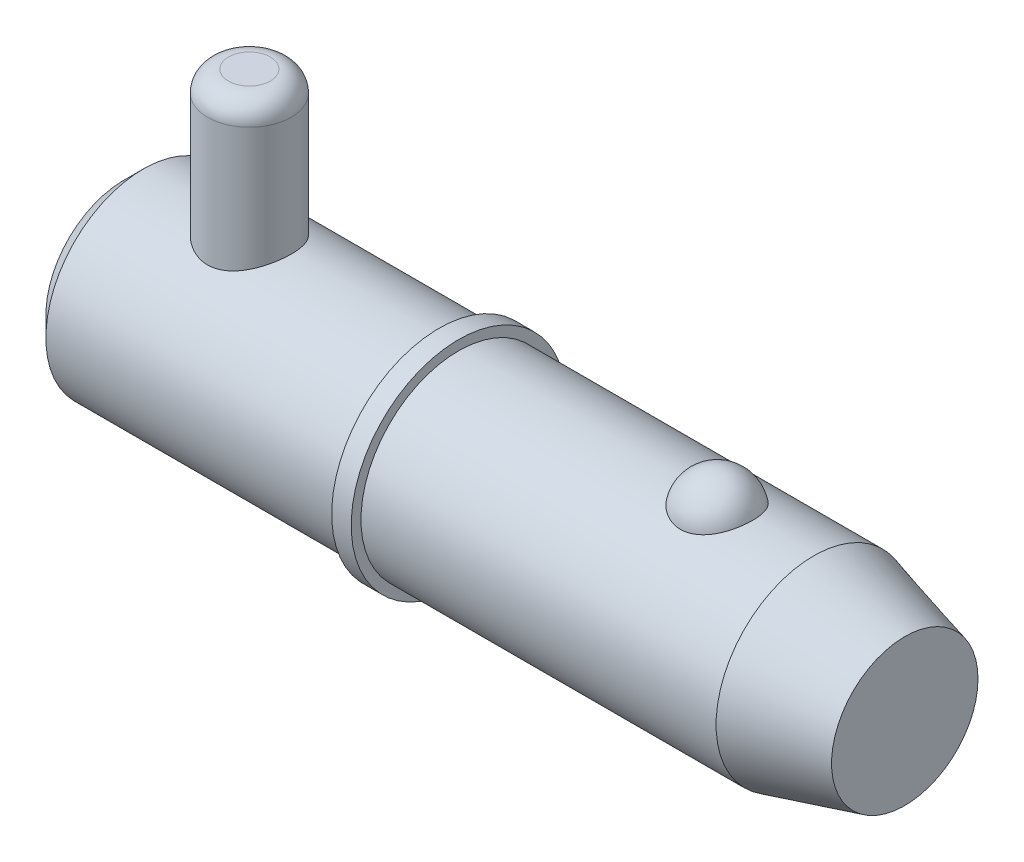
ISO-10303-21;
HEADER;
FILE_DESCRIPTION(('STEP AP214'),'2;1');
FILE_NAME('part.step','',(''),(''),'','','');
FILE_SCHEMA(('AUTOMOTIVE_DESIGN { 1 0 10303 214 1 1 1 1 }'));
ENDSEC;
DATA;
#1=APPLICATION_CONTEXT('core data for automotive mechanical design processes');
#2=APPLICATION_PROTOCOL_DEFINITION('international standard','automotive_design',2000,#1);
#3=PRODUCT_CONTEXT('',#1,'mechanical');
#4=PRODUCT('Part','Part','',(#3));
#5=PRODUCT_RELATED_PRODUCT_CATEGORY('part','',(#4));
#6=PRODUCT_DEFINITION_FORMATION('','',#4);
#7=PRODUCT_DEFINITION_CONTEXT('part definition',#1,'design');
#8=PRODUCT_DEFINITION('design','',#6,#7);
#9=PRODUCT_DEFINITION_SHAPE('','',#8);
#10=(LENGTH_UNIT() NAMED_UNIT(*) SI_UNIT(.MILLI.,.METRE.));
#11=(NAMED_UNIT(*) PLANE_ANGLE_UNIT() SI_UNIT($,.RADIAN.));
#12=(NAMED_UNIT(*) SI_UNIT($,.STERADIAN.) SOLID_ANGLE_UNIT());
#13=UNCERTAINTY_MEASURE_WITH_UNIT(LENGTH_MEASURE(1.E-05),#10,'distance_accuracy_value','');
#14=(GEOMETRIC_REPRESENTATION_CONTEXT(3) GLOBAL_UNCERTAINTY_ASSIGNED_CONTEXT((#13)) GLOBAL_UNIT_ASSIGNED_CONTEXT((#10,
#11,#12)) REPRESENTATION_CONTEXT('',''));
#15=CARTESIAN_POINT('',(0.,0.,0.));
#16=DIRECTION('',(0.,0.,1.));
#17=DIRECTION('',(1.,0.,0.));
#18=AXIS2_PLACEMENT_3D('',#15,#16,#17);
#19=CARTESIAN_POINT('',(14.28,26.985,0.));
#20=DIRECTION('',(0.,-1.,0.));
#21=DIRECTION('',(0.,0.,-1.));
#22=AXIS2_PLACEMENT_3D('',#19,#20,#21);
#23=CYLINDRICAL_SURFACE('',#22,4.76);
#24=CARTESIAN_POINT('',(14.28,-8.73500000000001,0.));
#25=DIRECTION('',(0.,1.,0.));
#26=DIRECTION('',(0.,0.,1.));
#27=AXIS2_PLACEMENT_3D('',#24,#25,#26);
#28=CIRCLE('',#27,4.76);
#29=CARTESIAN_POINT('',(14.28,-8.73500000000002,-4.76));
#30=VERTEX_POINT('',#29);
#31=EDGE_CURVE('P0_E25',#30,#30,#28,.T.);
#32=CARTESIAN_POINT('',(14.28,24.605,0.));
#33=DIRECTION('',(0.,1.,0.));
#34=DIRECTION('',(0.,0.,1.));
#35=AXIS2_PLACEMENT_3D('',#32,#33,#34);
#36=CIRCLE('',#35,4.76);
#37=CARTESIAN_POINT('',(14.28,24.605,-4.76));
#38=VERTEX_POINT('',#37);
#39=EDGE_CURVE('P0_E29',#38,#38,#36,.F.);
#40=CARTESIAN_POINT('',(14.28,-8.73500000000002,-4.76));
#41=CARTESIAN_POINT('',(14.28,-8.38770833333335,-4.76));
#42=CARTESIAN_POINT('',(14.28,-8.04041666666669,-4.76));
#43=CARTESIAN_POINT('',(14.28,-7.34583333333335,-4.76));
#44=CARTESIAN_POINT('',(14.28,-6.99854166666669,-4.76));
#45=CARTESIAN_POINT('',(14.28,-6.30395833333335,-4.76));
#46=CARTESIAN_POINT('',(14.28,-5.95666666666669,-4.76));
#47=CARTESIAN_POINT('',(14.28,-5.26208333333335,-4.76));
#48=CARTESIAN_POINT('',(14.28,-4.91479166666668,-4.76));
#49=CARTESIAN_POINT('',(14.28,-4.22020833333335,-4.76));
#50=CARTESIAN_POINT('',(14.28,-3.87291666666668,-4.76));
#51=CARTESIAN_POINT('',(14.28,-3.17833333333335,-4.76));
#52=CARTESIAN_POINT('',(14.28,-2.83104166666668,-4.76));
#53=CARTESIAN_POINT('',(14.28,-2.13645833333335,-4.76));
#54=CARTESIAN_POINT('',(14.28,-1.78916666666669,-4.76));
#55=CARTESIAN_POINT('',(14.28,-1.09458333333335,-4.76));
#56=CARTESIAN_POINT('',(14.28,-0.747291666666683,-4.76));
#57=CARTESIAN_POINT('',(14.28,-0.052708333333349,-4.76));
#58=CARTESIAN_POINT('',(14.28,0.294583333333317,-4.76));
#59=CARTESIAN_POINT('',(14.28,0.989166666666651,-4.76));
#60=CARTESIAN_POINT('',(14.28,1.33645833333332,-4.76));
#61=CARTESIAN_POINT('',(14.28,2.03104166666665,-4.76));
#62=CARTESIAN_POINT('',(14.28,2.37833333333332,-4.76));
#63=CARTESIAN_POINT('',(14.28,3.07291666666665,-4.76));
#64=CARTESIAN_POINT('',(14.28,3.42020833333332,-4.76));
#65=CARTESIAN_POINT('',(14.28,4.11479166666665,-4.76));
#66=CARTESIAN_POINT('',(14.28,4.46208333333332,-4.76));
#67=CARTESIAN_POINT('',(14.28,5.15666666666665,-4.76));
#68=CARTESIAN_POINT('',(14.28,5.50395833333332,-4.76));
#69=CARTESIAN_POINT('',(14.28,6.19854166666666,-4.76));
#70=CARTESIAN_POINT('',(14.28,6.54583333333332,-4.76));
#71=CARTESIAN_POINT('',(14.28,7.24041666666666,-4.76));
#72=CARTESIAN_POINT('',(14.28,7.58770833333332,-4.76));
#73=CARTESIAN_POINT('',(14.28,8.28229166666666,-4.76));
#74=CARTESIAN_POINT('',(14.28,8.62958333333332,-4.76));
#75=CARTESIAN_POINT('',(14.28,9.32416666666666,-4.76));
#76=CARTESIAN_POINT('',(14.28,9.67145833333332,-4.76));
#77=CARTESIAN_POINT('',(14.28,10.3660416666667,-4.76));
#78=CARTESIAN_POINT('',(14.28,10.7133333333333,-4.76));
#79=CARTESIAN_POINT('',(14.28,11.4079166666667,-4.76));
#80=CARTESIAN_POINT('',(14.28,11.7552083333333,-4.76));
#81=CARTESIAN_POINT('',(14.28,12.4497916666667,-4.76));
#82=CARTESIAN_POINT('',(14.28,12.7970833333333,-4.76));
#83=CARTESIAN_POINT('',(14.28,13.4916666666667,-4.76));
#84=CARTESIAN_POINT('',(14.28,13.8389583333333,-4.76));
#85=CARTESIAN_POINT('',(14.28,14.5335416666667,-4.76));
#86=CARTESIAN_POINT('',(14.28,14.8808333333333,-4.76));
#87=CARTESIAN_POINT('',(14.28,15.5754166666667,-4.76));
#88=CARTESIAN_POINT('',(14.28,15.9227083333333,-4.76));
#89=CARTESIAN_POINT('',(14.28,16.6172916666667,-4.76));
#90=CARTESIAN_POINT('',(14.28,16.9645833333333,-4.76));
#91=CARTESIAN_POINT('',(14.28,17.6591666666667,-4.76));
#92=CARTESIAN_POINT('',(14.28,18.0064583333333,-4.76));
#93=CARTESIAN_POINT('',(14.28,18.7010416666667,-4.76));
#94=CARTESIAN_POINT('',(14.28,19.0483333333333,-4.76));
#95=CARTESIAN_POINT('',(14.28,19.7429166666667,-4.76));
#96=CARTESIAN_POINT('',(14.28,20.0902083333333,-4.76));
#97=CARTESIAN_POINT('',(14.28,20.7847916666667,-4.76));
#98=CARTESIAN_POINT('',(14.28,21.1320833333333,-4.76));
#99=CARTESIAN_POINT('',(14.28,21.8266666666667,-4.76));
#100=CARTESIAN_POINT('',(14.28,22.1739583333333,-4.76));
#101=CARTESIAN_POINT('',(14.28,22.8685416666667,-4.76));
#102=CARTESIAN_POINT('',(14.28,23.2158333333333,-4.76));
#103=CARTESIAN_POINT('',(14.28,23.9104166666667,-4.76));
#104=CARTESIAN_POINT('',(14.28,24.2577083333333,-4.76));
#105=CARTESIAN_POINT('',(14.28,24.605,-4.76));
#106=B_SPLINE_CURVE_WITH_KNOTS('',3,(#40,#41,#42,#43,#44,#45,#46,#47,#48,#49,#50,#51,#52,#53,
#54,#55,#56,#57,#58,#59,#60,#61,#62,#63,#64,#65,#66,#67,#68,#69,#70,#71,#72,#73,#74,#75,#76,#77,
#78,#79,#80,#81,#82,#83,#84,#85,#86,#87,#88,#89,#90,#91,#92,#93,#94,#95,#96,#97,#98,#99,#100,
#101,#102,#103,#104,#105),.UNSPECIFIED.,.F.,.F.,(4,2,2,2,2,2,2,2,2,2,2,2,2,2,2,2,2,2,2,2,2,2,2,
2,2,2,2,2,2,2,2,2,4),(0.,1.041875,2.08375,3.125625,4.1675,5.209375,6.25125,7.293125,
8.33500000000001,9.376875,10.41875,11.460625,12.5025,13.544375,14.58625,15.628125,16.67,
17.711875,18.75375,19.795625,20.8375,21.879375,22.92125,23.963125,25.005,26.046875,27.08875,
28.130625,29.1725,30.214375,31.25625,32.298125,33.34),.UNSPECIFIED.);
#107=EDGE_CURVE('P0_BSEAM14',#30,#38,#106,.T.);
#108=ORIENTED_EDGE('',*,*,#31,.T.);
#109=ORIENTED_EDGE('',*,*,#39,.T.);
#110=ORIENTED_EDGE('',*,*,#107,.T.);
#111=ORIENTED_EDGE('',*,*,#107,.F.);
#112=EDGE_LOOP('',(#108,#110,#109,#111));
#113=FACE_BOUND('',#112,.T.);
#114=ADVANCED_FACE('P0_F14',(#113),#23,.T.);
#115=CARTESIAN_POINT('',(14.28,26.985,0.));
#116=DIRECTION('',(0.,1.,0.));
#117=DIRECTION('',(0.,0.,1.));
#118=AXIS2_PLACEMENT_3D('',#115,#116,#117);
#119=PLANE('',#118);
#120=CARTESIAN_POINT('',(14.28,26.985,0.));
#121=DIRECTION('',(0.,1.,0.));
#122=DIRECTION('',(0.,0.,1.));
#123=AXIS2_PLACEMENT_3D('',#120,#121,#122);
#124=CIRCLE('',#123,2.38);
#125=CARTESIAN_POINT('',(14.28,26.985,2.38));
#126=VERTEX_POINT('',#125);
#127=EDGE_CURVE('P0_E10',#126,#126,#124,.T.);
#128=ORIENTED_EDGE('',*,*,#127,.T.);
#129=EDGE_LOOP('',(#128));
#130=FACE_BOUND('',#129,.T.);
#131=ADVANCED_FACE('P0_F46',(#130),#119,.T.);
#132=CARTESIAN_POINT('',(14.28,-11.115,0.));
#133=DIRECTION('',(0.,1.,0.));
#134=DIRECTION('',(0.,0.,1.));
#135=AXIS2_PLACEMENT_3D('',#132,#133,#134);
#136=PLANE('',#135);
#137=CARTESIAN_POINT('',(14.28,-11.115,0.));
#138=DIRECTION('',(0.,1.,0.));
#139=DIRECTION('',(0.,0.,1.));
#140=AXIS2_PLACEMENT_3D('',#137,#138,#139);
#141=CIRCLE('',#140,2.38);
#142=CARTESIAN_POINT('',(14.28,-11.115,2.38));
#143=VERTEX_POINT('',#142);
#144=EDGE_CURVE('P0_E21',#143,#143,#141,.F.);
#145=ORIENTED_EDGE('',*,*,#144,.T.);
#146=EDGE_LOOP('',(#145));
#147=FACE_BOUND('',#146,.T.);
#148=ADVANCED_FACE('P0_F43',(#147),#136,.F.);
#149=CARTESIAN_POINT('',(14.28,-8.735,0.));
#150=DIRECTION('',(0.,1.,0.));
#151=DIRECTION('',(0.,0.,1.));
#152=AXIS2_PLACEMENT_3D('',#149,#150,#151);
#153=DEGENERATE_TOROIDAL_SURFACE('',#152,2.38,2.38,.T.);
#154=ORIENTED_EDGE('',*,*,#144,.F.);
#155=EDGE_LOOP('',(#154));
#156=FACE_BOUND('',#155,.T.);
#157=ORIENTED_EDGE('',*,*,#31,.F.);
#158=EDGE_LOOP('',(#157));
#159=FACE_BOUND('',#158,.T.);
#160=ADVANCED_FACE('P0_F38',(#156,#159),#153,.T.);
#161=CARTESIAN_POINT('',(14.28,24.605,0.));
#162=DIRECTION('',(0.,1.,0.));
#163=DIRECTION('',(0.,0.,1.));
#164=AXIS2_PLACEMENT_3D('',#161,#162,#163);
#165=DEGENERATE_TOROIDAL_SURFACE('',#164,2.38,2.38,.T.);
#166=ORIENTED_EDGE('',*,*,#39,.F.);
#167=EDGE_LOOP('',(#166));
#168=FACE_BOUND('',#167,.T.);
#169=ORIENTED_EDGE('',*,*,#127,.F.);
#170=EDGE_LOOP('',(#169));
#171=FACE_BOUND('',#170,.T.);
#172=ADVANCED_FACE('P0_F16',(#168,#171),#165,.T.);
#173=CLOSED_SHELL('',(#114,#131,#148,#160,#172));
#174=MANIFOLD_SOLID_BREP('P0_B1',#173);
#175=CARTESIAN_POINT('',(0.,0.,0.));
#176=DIRECTION('',(1.,0.,0.));
#177=DIRECTION('',(0.,0.,-1.));
#178=AXIS2_PLACEMENT_3D('',#175,#176,#177);
#179=CYLINDRICAL_SURFACE('',#178,11.115);
#180=CARTESIAN_POINT('',(78.529563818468,0.,0.));
#181=DIRECTION('',(1.,0.,0.));
#182=DIRECTION('',(0.,0.,-1.));
#183=AXIS2_PLACEMENT_3D('',#180,#181,#182);
#184=CIRCLE('',#183,11.115);
#185=CARTESIAN_POINT('',(78.529563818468,0.,-11.115));
#186=VERTEX_POINT('',#185);
#187=EDGE_CURVE('P1_E81',#186,#186,#184,.T.);
#188=ORIENTED_EDGE('',*,*,#187,.F.);
#189=EDGE_LOOP('',(#188));
#190=FACE_BOUND('',#189,.T.);
#191=CARTESIAN_POINT('',(38.1,0.,0.));
#192=DIRECTION('',(1.,0.,0.));
#193=DIRECTION('',(0.,0.,-1.));
#194=AXIS2_PLACEMENT_3D('',#191,#192,#193);
#195=CIRCLE('',#194,11.115);
#196=CARTESIAN_POINT('',(38.1,0.,-11.115));
#197=VERTEX_POINT('',#196);
#198=EDGE_CURVE('P1_E85',#197,#197,#195,.T.);
#199=ORIENTED_EDGE('',*,*,#198,.T.);
#200=EDGE_LOOP('',(#199));
#201=FACE_BOUND('',#200,.T.);
#202=CARTESIAN_POINT('',(67.5310680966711,10.3028087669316,4.17077409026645));
#203=CARTESIAN_POINT('',(67.3147756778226,10.3028003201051,4.17078240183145));
#204=CARTESIAN_POINT('',(67.0985488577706,10.3098895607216,4.15340593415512));
#205=CARTESIAN_POINT('',(66.6725408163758,10.3373834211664,4.08449540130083));
#206=CARTESIAN_POINT('',(66.4627577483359,10.3577841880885,4.03297121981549));
#207=CARTESIAN_POINT('',(66.0557825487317,10.4095237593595,3.89746513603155));
#208=CARTESIAN_POINT('',(65.8585726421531,10.4408466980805,3.81353029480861));
#209=CARTESIAN_POINT('',(65.4813382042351,10.5110236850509,3.61560339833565));
#210=CARTESIAN_POINT('',(65.3013171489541,10.5498792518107,3.50160528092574));
#211=CARTESIAN_POINT('',(64.9576842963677,10.6322884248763,3.24292464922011));
#212=CARTESIAN_POINT('',(64.7946861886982,10.6759443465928,3.09746040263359));
#213=CARTESIAN_POINT('',(64.4945911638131,10.7625291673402,2.78171925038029));
#214=CARTESIAN_POINT('',(64.3574990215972,10.8054579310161,2.61143778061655));
#215=CARTESIAN_POINT('',(64.1064084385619,10.8881935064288,2.24226695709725));
#216=CARTESIAN_POINT('',(63.9937105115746,10.9277761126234,2.04244123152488));
#217=CARTESIAN_POINT('',(63.8017771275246,10.997484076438,1.62578254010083));
#218=CARTESIAN_POINT('',(63.722544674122,11.0276085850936,1.40894804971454));
#219=CARTESIAN_POINT('',(63.5983034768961,11.0756732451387,0.961250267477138));
#220=CARTESIAN_POINT('',(63.553760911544,11.0934470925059,0.730239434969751));
#221=CARTESIAN_POINT('',(63.5015695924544,11.1143331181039,0.263439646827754));
#222=CARTESIAN_POINT('',(63.4939200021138,11.1174456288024,0.0276507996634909));
#223=CARTESIAN_POINT('',(63.5156105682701,11.1087161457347,-0.440729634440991));
#224=CARTESIAN_POINT('',(63.5447624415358,11.0969502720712,-0.673331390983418));
#225=CARTESIAN_POINT('',(63.6391432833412,11.0597872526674,-1.12996621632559));
#226=CARTESIAN_POINT('',(63.7043729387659,11.0343898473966,-1.35399912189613));
#227=CARTESIAN_POINT('',(63.8696984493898,10.972515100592,-1.78750286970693));
#228=CARTESIAN_POINT('',(63.9698386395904,10.9360236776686,-1.99695478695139));
#229=CARTESIAN_POINT('',(64.2029408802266,10.8557595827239,-2.3952066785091));
#230=CARTESIAN_POINT('',(64.3359054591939,10.8119863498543,-2.5840050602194));
#231=CARTESIAN_POINT('',(64.632407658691,10.7216733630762,-2.93635726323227));
#232=CARTESIAN_POINT('',(64.7960565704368,10.675123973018,-3.09981510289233));
#233=CARTESIAN_POINT('',(65.1498601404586,10.5846571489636,-3.39592247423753));
#234=CARTESIAN_POINT('',(65.3400123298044,10.5407394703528,-3.52857487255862));
#235=CARTESIAN_POINT('',(65.7375014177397,10.4616690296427,-3.75646057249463));
#236=CARTESIAN_POINT('',(65.9443670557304,10.4263443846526,-3.85245432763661));
#237=CARTESIAN_POINT('',(66.3729541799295,10.3675574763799,-4.00798747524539));
#238=CARTESIAN_POINT('',(66.594670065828,10.3440907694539,-4.0675405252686));
#239=CARTESIAN_POINT('',(67.0346695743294,10.3128282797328,-4.14614314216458));
#240=CARTESIAN_POINT('',(67.2525654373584,10.3043040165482,-4.1670783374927));
#241=CARTESIAN_POINT('',(67.68894951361,10.3016771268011,-4.17357158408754));
#242=CARTESIAN_POINT('',(67.9074376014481,10.3075716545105,-4.15913661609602));
#243=CARTESIAN_POINT('',(68.3317442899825,10.3326686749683,-4.09636961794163));
#244=CARTESIAN_POINT('',(68.5377458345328,10.3514555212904,-4.0490957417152));
#245=CARTESIAN_POINT('',(68.9385764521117,10.399818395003,-3.92320197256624));
#246=CARTESIAN_POINT('',(69.1334046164,10.4293952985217,-3.84457953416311));
#247=CARTESIAN_POINT('',(69.5111917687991,10.4969600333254,-3.65612410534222));
#248=CARTESIAN_POINT('',(69.6937974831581,10.5351178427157,-3.54564545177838));
#249=CARTESIAN_POINT('',(70.0382040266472,10.6154999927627,-3.29718036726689));
#250=CARTESIAN_POINT('',(70.200000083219,10.657725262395,-3.15918764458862));
#251=CARTESIAN_POINT('',(70.5069596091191,10.744212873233,-2.85163580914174));
#252=CARTESIAN_POINT('',(70.6508919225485,10.7884718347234,-2.68084605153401));
#253=CARTESIAN_POINT('',(70.9092371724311,10.872374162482,-2.31721864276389));
#254=CARTESIAN_POINT('',(71.0236448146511,10.9120167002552,-2.12437704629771));
#255=CARTESIAN_POINT('',(71.2238739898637,10.9838919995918,-1.71516999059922));
#256=CARTESIAN_POINT('',(71.3086617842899,11.0158465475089,-1.498248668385));
#257=CARTESIAN_POINT('',(71.4426838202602,11.0673523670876,-1.052285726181));
#258=CARTESIAN_POINT('',(71.4919174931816,11.086903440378,-0.823243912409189));
#259=CARTESIAN_POINT('',(71.5538915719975,11.1116323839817,-0.359087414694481));
#260=CARTESIAN_POINT('',(71.5665662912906,11.1167843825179,-0.123962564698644));
#261=CARTESIAN_POINT('',(71.554973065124,11.1121144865,0.345220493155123));
#262=CARTESIAN_POINT('',(71.5307056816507,11.1022928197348,0.579278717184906));
#263=CARTESIAN_POINT('',(71.4459073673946,11.0687504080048,1.03866534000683));
#264=CARTESIAN_POINT('',(71.3855299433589,11.0450885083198,1.26402641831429));
#265=CARTESIAN_POINT('',(71.2298532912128,10.9863185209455,1.70076772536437));
#266=CARTESIAN_POINT('',(71.134551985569,10.9512097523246,1.91214712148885));
#267=CARTESIAN_POINT('',(70.9103974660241,10.8729733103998,2.31608359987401));
#268=CARTESIAN_POINT('',(70.7813806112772,10.8298068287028,2.50854240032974));
#269=CARTESIAN_POINT('',(70.4927327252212,10.7401896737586,2.86808766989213));
#270=CARTESIAN_POINT('',(70.3331022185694,10.6937390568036,3.03517457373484));
#271=CARTESIAN_POINT('',(69.9875341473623,10.6029321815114,3.33857581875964));
#272=CARTESIAN_POINT('',(69.8017089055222,10.5585680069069,3.47501541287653));
#273=CARTESIAN_POINT('',(69.4078750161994,10.4769321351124,3.71390897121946));
#274=CARTESIAN_POINT('',(69.1998635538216,10.439661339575,3.81635861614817));
#275=CARTESIAN_POINT('',(68.7540666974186,10.3749407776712,3.98910631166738));
#276=CARTESIAN_POINT('',(68.5152342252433,10.3482457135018,4.05700929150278));
#277=CARTESIAN_POINT('',(68.0279254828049,10.312188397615,4.14782844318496));
#278=CARTESIAN_POINT('',(67.7794535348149,10.3028184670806,4.17076454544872));
#279=CARTESIAN_POINT('',(67.5310680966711,10.3028087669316,4.17077409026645));
#280=B_SPLINE_CURVE_WITH_KNOTS('',3,(#202,#203,#204,#205,#206,#207,#208,#209,#210,#211,#212,
#213,#214,#215,#216,#217,#218,#219,#220,#221,#222,#223,#224,#225,#226,#227,#228,#229,#230,#231,
#232,#233,#234,#235,#236,#237,#238,#239,#240,#241,#242,#243,#244,#245,#246,#247,#248,#249,#250,
#251,#252,#253,#254,#255,#256,#257,#258,#259,#260,#261,#262,#263,#264,#265,#266,#267,#268,#269,
#270,#271,#272,#273,#274,#275,#276,#277,#278,#279),.UNSPECIFIED.,.T.,.F.,(4,2,2,2,2,2,2,2,2,2,2,
2,2,2,2,2,2,2,2,2,2,2,2,2,2,2,2,2,2,2,2,2,2,2,2,2,2,2,4),(0.,0.647966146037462,1.29574482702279,
1.94258643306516,2.58955857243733,3.25496465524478,3.92049326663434,4.61566368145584,
5.31089647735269,6.01531821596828,6.71972398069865,7.42054043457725,8.12137023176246,
8.82309331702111,9.52487047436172,10.2292439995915,10.9335519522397,11.6223330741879,
12.3108558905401,12.9647664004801,13.6185478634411,14.2521847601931,14.8858731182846,
15.5334360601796,16.1811472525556,16.8611459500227,17.5412664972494,18.2431855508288,
18.9451158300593,19.6483065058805,20.3514864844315,21.0516982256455,21.7519516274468,
22.4556690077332,23.1593743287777,23.8601491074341,24.5610129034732,25.3054529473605,
26.049562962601),.UNSPECIFIED.);
#281=CARTESIAN_POINT('',(67.5310680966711,10.3028087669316,4.17077409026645));
#282=VERTEX_POINT('',#281);
#283=EDGE_CURVE('P1_E35',#282,#282,#280,.T.);
#284=ORIENTED_EDGE('',*,*,#283,.T.);
#285=EDGE_LOOP('',(#284));
#286=FACE_BOUND('',#285,.T.);
#287=ADVANCED_FACE('P1_F13',(#190,#201,#286),#179,.T.);
#288=CARTESIAN_POINT('',(0.,0.,0.));
#289=DIRECTION('',(-1.,0.,0.));
#290=DIRECTION('',(0.,0.,1.));
#291=AXIS2_PLACEMENT_3D('',#288,#289,#290);
#292=PLANE('',#291);
#293=CARTESIAN_POINT('',(0.,0.,0.));
#294=DIRECTION('',(1.,0.,0.));
#295=DIRECTION('',(0.,0.,-1.));
#296=AXIS2_PLACEMENT_3D('',#293,#294,#295);
#297=CIRCLE('',#296,8.892);
#298=CARTESIAN_POINT('',(0.,0.,-8.892));
#299=VERTEX_POINT('',#298);
#300=EDGE_CURVE('P1_E9',#299,#299,#297,.T.);
#301=ORIENTED_EDGE('',*,*,#300,.F.);
#302=EDGE_LOOP('',(#301));
#303=FACE_BOUND('',#302,.T.);
#304=ADVANCED_FACE('P1_F15',(#303),#292,.T.);
#305=CARTESIAN_POINT('',(2.22299999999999,0.,0.));
#306=DIRECTION('',(1.,0.,0.));
#307=DIRECTION('',(0.,0.,-1.));
#308=AXIS2_PLACEMENT_3D('',#305,#306,#307);
#309=CONICAL_SURFACE('',#308,11.115,0.78539816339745);
#310=ORIENTED_EDGE('',*,*,#300,.T.);
#311=EDGE_LOOP('',(#310));
#312=FACE_BOUND('',#311,.T.);
#313=CARTESIAN_POINT('',(2.22299999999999,0.,0.));
#314=DIRECTION('',(1.,0.,0.));
#315=DIRECTION('',(0.,0.,-1.));
#316=AXIS2_PLACEMENT_3D('',#313,#314,#315);
#317=CIRCLE('',#316,11.115);
#318=CARTESIAN_POINT('',(2.22299999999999,0.,-11.115));
#319=VERTEX_POINT('',#318);
#320=EDGE_CURVE('P1_E26',#319,#319,#317,.T.);
#321=ORIENTED_EDGE('',*,*,#320,.F.);
#322=EDGE_LOOP('',(#321));
#323=FACE_BOUND('',#322,.T.);
#324=ADVANCED_FACE('P1_F77',(#312,#323),#309,.T.);
#325=CARTESIAN_POINT('',(0.,0.,0.));
#326=DIRECTION('',(1.,0.,0.));
#327=DIRECTION('',(0.,0.,-1.));
#328=AXIS2_PLACEMENT_3D('',#325,#326,#327);
#329=CYLINDRICAL_SURFACE('',#328,11.115);
#330=CARTESIAN_POINT('',(14.28,-10.0441836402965,4.76));
#331=CARTESIAN_POINT('',(14.1533731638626,-10.0441846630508,4.75999904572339));
#332=CARTESIAN_POINT('',(14.0267055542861,-10.0465865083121,4.75493985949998));
#333=CARTESIAN_POINT('',(13.774298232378,-10.0561141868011,4.73475585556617));
#334=CARTESIAN_POINT('',(13.6485591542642,-10.0632429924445,4.71962470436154));
#335=CARTESIAN_POINT('',(13.3987500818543,-10.0819979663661,4.67942666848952));
#336=CARTESIAN_POINT('',(13.2746840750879,-10.0936334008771,4.65433930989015));
#337=CARTESIAN_POINT('',(13.0293244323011,-10.1210146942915,4.59449317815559));
#338=CARTESIAN_POINT('',(12.9080319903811,-10.1367622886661,4.55973032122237));
#339=CARTESIAN_POINT('',(12.669614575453,-10.1717810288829,4.48106435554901));
#340=CARTESIAN_POINT('',(12.5524727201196,-10.1910352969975,4.4372048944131));
#341=CARTESIAN_POINT('',(12.3224300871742,-10.2325403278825,4.34063417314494));
#342=CARTESIAN_POINT('',(12.2095309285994,-10.2547922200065,4.28791957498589));
#343=CARTESIAN_POINT('',(11.8782785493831,-10.3250879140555,4.11715127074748));
#344=CARTESIAN_POINT('',(11.6670799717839,-10.3767168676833,3.98637638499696));
#345=CARTESIAN_POINT('',(11.2564039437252,-10.4874309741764,3.68567149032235));
#346=CARTESIAN_POINT('',(11.0583793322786,-10.5467772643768,3.51386978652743));
#347=CARTESIAN_POINT('',(10.6927724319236,-10.6641377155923,3.13969960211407));
#348=CARTESIAN_POINT('',(10.5252022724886,-10.7221513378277,2.93731900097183));
#349=CARTESIAN_POINT('',(10.2965609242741,-10.8050020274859,2.60935726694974));
#350=CARTESIAN_POINT('',(10.2227768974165,-10.8324811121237,2.49310321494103));
#351=CARTESIAN_POINT('',(10.0853380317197,-10.884703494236,2.25418999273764));
#352=CARTESIAN_POINT('',(10.0216789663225,-10.9094479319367,2.13153352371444));
#353=CARTESIAN_POINT('',(9.90506238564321,-10.9554932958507,1.88060370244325));
#354=CARTESIAN_POINT('',(9.85210574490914,-10.9767939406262,1.7523298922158));
#355=CARTESIAN_POINT('',(9.75746464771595,-11.0153112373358,1.49115740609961));
#356=CARTESIAN_POINT('',(9.71577447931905,-11.0325299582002,1.35826111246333));
#357=CARTESIAN_POINT('',(9.64605475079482,-11.0615607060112,1.09614539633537));
#358=CARTESIAN_POINT('',(9.61740732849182,-11.0736151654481,0.96711700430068));
#359=CARTESIAN_POINT('',(9.57092026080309,-11.0932687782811,0.706847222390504));
#360=CARTESIAN_POINT('',(9.55307574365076,-11.1008699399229,0.575606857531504));
#361=CARTESIAN_POINT('',(9.52838640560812,-11.1114054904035,0.31192917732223));
#362=CARTESIAN_POINT('',(9.52153986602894,-11.114340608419,0.179492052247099));
#363=CARTESIAN_POINT('',(9.51892405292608,-11.1154607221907,-0.0855090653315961));
#364=CARTESIAN_POINT('',(9.52315432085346,-11.1136459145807,-0.218073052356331));
#365=CARTESIAN_POINT('',(9.542009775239,-11.1055891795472,-0.473709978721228));
#366=CARTESIAN_POINT('',(9.55594693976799,-11.099640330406,-0.596843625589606));
#367=CARTESIAN_POINT('',(9.59332832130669,-11.0837823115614,-0.841440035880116));
#368=CARTESIAN_POINT('',(9.61677567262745,-11.0738718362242,-0.962902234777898));
#369=CARTESIAN_POINT('',(9.67294089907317,-11.0503378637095,-1.20325684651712));
#370=CARTESIAN_POINT('',(9.70565569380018,-11.0367156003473,-1.32215009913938));
#371=CARTESIAN_POINT('',(9.78005008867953,-11.0060908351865,-1.55666640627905));
#372=CARTESIAN_POINT('',(9.82173311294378,-10.9890870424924,-1.67228819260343));
#373=CARTESIAN_POINT('',(9.96110379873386,-10.9330280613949,-2.01656166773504));
#374=CARTESIAN_POINT('',(10.0722987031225,-10.8892801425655,-2.23915547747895));
#375=CARTESIAN_POINT('',(10.3268588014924,-10.7934745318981,-2.66299199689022));
#376=CARTESIAN_POINT('',(10.4702355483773,-10.7414138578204,-2.86422700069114));
#377=CARTESIAN_POINT('',(10.7973904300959,-10.6296201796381,-3.25557775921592));
#378=CARTESIAN_POINT('',(10.9833705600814,-10.569604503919,-3.443774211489));
#379=CARTESIAN_POINT('',(11.3844486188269,-10.4514707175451,-3.78722133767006));
#380=CARTESIAN_POINT('',(11.5995590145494,-10.3933534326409,-3.94245783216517));
#381=CARTESIAN_POINT('',(11.9444340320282,-10.311516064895,-4.14990014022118));
#382=CARTESIAN_POINT('',(12.0654579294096,-10.2847012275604,-4.21573894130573));
#383=CARTESIAN_POINT('',(12.3132718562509,-10.2342051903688,-4.33688518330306));
#384=CARTESIAN_POINT('',(12.4400593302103,-10.2105226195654,-4.39219723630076));
#385=CARTESIAN_POINT('',(12.6985418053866,-10.1671237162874,-4.49174500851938));
#386=CARTESIAN_POINT('',(12.8302359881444,-10.1474067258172,-4.53598256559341));
#387=CARTESIAN_POINT('',(13.0975061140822,-10.1126841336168,-4.61287629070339));
#388=CARTESIAN_POINT('',(13.233079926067,-10.0976759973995,-4.64553869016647));
#389=CARTESIAN_POINT('',(13.4978553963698,-10.0737863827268,-4.6971059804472));
#390=CARTESIAN_POINT('',(13.6268754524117,-10.0645618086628,-4.716785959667));
#391=CARTESIAN_POINT('',(13.8862990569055,-10.051062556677,-4.74548419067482));
#392=CARTESIAN_POINT('',(14.0167019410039,-10.0467856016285,-4.75450734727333));
#393=CARTESIAN_POINT('',(14.277859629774,-10.0433352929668,-4.76179143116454));
#394=CARTESIAN_POINT('',(14.4086143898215,-10.0441613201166,-4.76005366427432));
#395=CARTESIAN_POINT('',(14.6694025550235,-10.0508838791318,-4.74584231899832));
#396=CARTESIAN_POINT('',(14.7994359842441,-10.0567802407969,-4.73336910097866));
#397=CARTESIAN_POINT('',(15.0487369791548,-10.0728449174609,-4.69907984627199));
#398=CARTESIAN_POINT('',(15.1681238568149,-10.0826872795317,-4.67797462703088));
#399=CARTESIAN_POINT('',(15.4045894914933,-10.1062580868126,-4.62682977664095));
#400=CARTESIAN_POINT('',(15.5216674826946,-10.1199877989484,-4.59678723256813));
#401=CARTESIAN_POINT('',(15.868278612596,-10.1664161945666,-4.49365911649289));
#402=CARTESIAN_POINT('',(16.0933756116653,-10.2043671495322,-4.40754694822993));
#403=CARTESIAN_POINT('',(16.5357981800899,-10.2919879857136,-4.19898201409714));
#404=CARTESIAN_POINT('',(16.7523611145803,-10.3420954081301,-4.07511281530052));
#405=CARTESIAN_POINT('',(17.1627188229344,-10.4477911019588,-3.7959429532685));
#406=CARTESIAN_POINT('',(17.3565033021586,-10.5033818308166,-3.64062816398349));
#407=CARTESIAN_POINT('',(17.7334034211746,-10.6196376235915,-3.28693729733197));
#408=CARTESIAN_POINT('',(17.9141276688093,-10.6803237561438,-3.08599175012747));
#409=CARTESIAN_POINT('',(18.1582189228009,-10.7666348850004,-2.76320365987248));
#410=CARTESIAN_POINT('',(18.2351223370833,-10.7946346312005,-2.65197124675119));
#411=CARTESIAN_POINT('',(18.3793967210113,-10.8483267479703,-2.42297927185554));
#412=CARTESIAN_POINT('',(18.4467718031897,-10.87402011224,-2.30522255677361));
#413=CARTESIAN_POINT('',(18.5717669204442,-10.9225249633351,-2.06324665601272));
#414=CARTESIAN_POINT('',(18.6293326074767,-10.9453202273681,-1.93899615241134));
#415=CARTESIAN_POINT('',(18.73370006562,-10.9872100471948,-1.6855059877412));
#416=CARTESIAN_POINT('',(18.7805065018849,-11.0063062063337,-1.55626851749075));
#417=CARTESIAN_POINT('',(18.8628731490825,-11.0402419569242,-1.29375150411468));
#418=CARTESIAN_POINT('',(18.8984366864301,-11.0550828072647,-1.16047316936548));
#419=CARTESIAN_POINT('',(18.9579183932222,-11.0800638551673,-0.890912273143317));
#420=CARTESIAN_POINT('',(18.9818374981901,-11.0902044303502,-0.75462995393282));
#421=CARTESIAN_POINT('',(19.0164177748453,-11.104911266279,-0.490295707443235));
#422=CARTESIAN_POINT('',(19.027922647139,-11.1098318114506,-0.362373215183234));
#423=CARTESIAN_POINT('',(19.040554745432,-11.1152360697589,-0.105876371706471));
#424=CARTESIAN_POINT('',(19.0416784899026,-11.1157182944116,0.0226981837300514));
#425=CARTESIAN_POINT('',(19.0335275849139,-11.1122291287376,0.27938352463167));
#426=CARTESIAN_POINT('',(19.0242587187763,-11.1082602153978,0.407494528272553));
#427=CARTESIAN_POINT('',(18.9954320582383,-11.0959792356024,0.662388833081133));
#428=CARTESIAN_POINT('',(18.9758704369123,-11.0876655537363,0.789171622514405));
#429=CARTESIAN_POINT('',(18.9276379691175,-11.0673259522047,1.03545890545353));
#430=CARTESIAN_POINT('',(18.8993573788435,-11.0554596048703,1.15505309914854));
#431=CARTESIAN_POINT('',(18.8337694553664,-11.0282166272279,1.39134516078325));
#432=CARTESIAN_POINT('',(18.7964589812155,-11.0128387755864,1.5080420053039));
#433=CARTESIAN_POINT('',(18.671464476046,-10.9619666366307,1.85262797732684));
#434=CARTESIAN_POINT('',(18.5706772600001,-10.9217161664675,2.07521484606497));
#435=CARTESIAN_POINT('',(18.33202463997,-10.8301378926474,2.51061719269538));
#436=CARTESIAN_POINT('',(18.1926775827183,-10.7783885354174,2.72252375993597));
#437=CARTESIAN_POINT('',(17.8829747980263,-10.669863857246,3.12088015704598));
#438=CARTESIAN_POINT('',(17.7126068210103,-10.6130865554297,3.30731987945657));
#439=CARTESIAN_POINT('',(17.3310036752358,-10.495668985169,3.66358491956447));
#440=CARTESIAN_POINT('',(17.1177010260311,-10.4350471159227,3.83122543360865));
#441=CARTESIAN_POINT('',(16.7778915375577,-10.3495418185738,4.05420569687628));
#442=CARTESIAN_POINT('',(16.6612023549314,-10.3219229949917,4.12383380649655));
#443=CARTESIAN_POINT('',(16.4218466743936,-10.2693487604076,4.25306463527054));
#444=CARTESIAN_POINT('',(16.2991829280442,-10.2443921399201,4.31267191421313));
#445=CARTESIAN_POINT('',(16.0488008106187,-10.1979981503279,4.42126071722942));
#446=CARTESIAN_POINT('',(15.9210894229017,-10.1765561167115,4.47025635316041));
#447=CARTESIAN_POINT('',(15.6613937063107,-10.1379191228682,4.55720152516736));
#448=CARTESIAN_POINT('',(15.5294115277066,-10.1207220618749,4.59515652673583));
#449=CARTESIAN_POINT('',(15.2624981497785,-10.091252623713,4.65951684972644));
#450=CARTESIAN_POINT('',(15.1275757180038,-10.0789672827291,4.68595259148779));
#451=CARTESIAN_POINT('',(14.8556442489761,-10.0597530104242,4.72706206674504));
#452=CARTESIAN_POINT('',(14.7186368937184,-10.0528199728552,4.74174481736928));
#453=CARTESIAN_POINT('',(14.5310955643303,-10.047196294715,4.75363843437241));
#454=CARTESIAN_POINT('',(14.48091543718,-10.0460674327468,4.75602323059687));
#455=CARTESIAN_POINT('',(14.3804923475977,-10.044560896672,4.7592042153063));
#456=CARTESIAN_POINT('',(14.3302493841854,-10.0441832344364,4.76000037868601));
#457=CARTESIAN_POINT('',(14.28,-10.0441836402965,4.76));
#458=B_SPLINE_CURVE_WITH_KNOTS('',3,(#330,#331,#332,#333,#334,#335,#336,#337,#338,#339,#340,
#341,#342,#343,#344,#345,#346,#347,#348,#349,#350,#351,#352,#353,#354,#355,#356,#357,#358,#359,
#360,#361,#362,#363,#364,#365,#366,#367,#368,#369,#370,#371,#372,#373,#374,#375,#376,#377,#378,
#379,#380,#381,#382,#383,#384,#385,#386,#387,#388,#389,#390,#391,#392,#393,#394,#395,#396,#397,
#398,#399,#400,#401,#402,#403,#404,#405,#406,#407,#408,#409,#410,#411,#412,#413,#414,#415,#416,
#417,#418,#419,#420,#421,#422,#423,#424,#425,#426,#427,#428,#429,#430,#431,#432,#433,#434,#435,
#436,#437,#438,#439,#440,#441,#442,#443,#444,#445,#446,#447,#448,#449,#450,#451,#452,#453,#454,
#455,#456,#457),.UNSPECIFIED.,.T.,.F.,(4,2,2,2,2,2,2,2,2,2,2,2,2,2,2,2,2,2,2,2,2,2,2,2,2,2,2,2,
2,2,2,2,2,2,2,2,2,2,2,2,2,2,2,2,2,2,2,2,2,2,2,2,2,2,2,2,2,2,2,2,2,2,2,4),(0.,0.379828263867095,
0.759895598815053,1.14074858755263,1.52176256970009,1.90098898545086,2.28035867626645,
3.03818035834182,3.84125131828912,4.6446414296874,5.06541657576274,5.48601561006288,
5.90664899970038,6.3270687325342,6.72470503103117,7.12216187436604,7.51955659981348,
7.91693487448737,8.28868404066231,8.66055582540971,9.03230414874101,9.40419465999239,
10.1585834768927,10.9132435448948,11.7236471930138,12.5343987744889,12.9550196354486,
13.3754557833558,13.7958221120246,14.2159617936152,14.6079540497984,14.9997658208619,
15.3915300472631,15.7832811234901,16.1477615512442,16.512360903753,17.240999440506,
18.0012974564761,18.761937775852,19.5886929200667,20.0025782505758,20.4162843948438,
20.832212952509,21.2479608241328,21.6635855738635,22.0791769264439,22.4642880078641,
22.8495282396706,23.2345541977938,23.6197234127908,23.9896813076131,24.3597680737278,
25.099327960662,25.8726239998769,26.6462260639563,27.4759193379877,27.8914891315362,
28.3068693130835,28.7216936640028,29.1363123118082,29.5498292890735,29.9630287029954,
30.113753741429,30.2644811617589),.UNSPECIFIED.);
#459=CARTESIAN_POINT('',(14.28,-10.0441836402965,4.76));
#460=VERTEX_POINT('',#459);
#461=EDGE_CURVE('P1_E17',#460,#460,#458,.T.);
#462=ORIENTED_EDGE('',*,*,#461,.F.);
#463=EDGE_LOOP('',(#462));
#464=FACE_BOUND('',#463,.T.);
#465=CARTESIAN_POINT('',(14.28,10.0441836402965,4.76));
#466=CARTESIAN_POINT('',(14.4066268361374,10.0441846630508,4.75999904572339));
#467=CARTESIAN_POINT('',(14.5332944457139,10.0465865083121,4.75493985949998));
#468=CARTESIAN_POINT('',(14.785701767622,10.0561141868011,4.73475585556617));
#469=CARTESIAN_POINT('',(14.9114408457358,10.0632429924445,4.71962470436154));
#470=CARTESIAN_POINT('',(15.1612499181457,10.0819979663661,4.67942666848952));
#471=CARTESIAN_POINT('',(15.2853159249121,10.0936334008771,4.65433930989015));
#472=CARTESIAN_POINT('',(15.5306755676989,10.1210146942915,4.59449317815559));
#473=CARTESIAN_POINT('',(15.6519680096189,10.1367622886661,4.55973032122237));
#474=CARTESIAN_POINT('',(15.890385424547,10.1717810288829,4.48106435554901));
#475=CARTESIAN_POINT('',(16.0075272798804,10.1910352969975,4.4372048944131));
#476=CARTESIAN_POINT('',(16.2375699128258,10.2325403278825,4.34063417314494));
#477=CARTESIAN_POINT('',(16.3504690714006,10.2547922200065,4.28791957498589));
#478=CARTESIAN_POINT('',(16.6817214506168,10.3250879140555,4.11715127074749));
#479=CARTESIAN_POINT('',(16.8929200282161,10.3767168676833,3.98637638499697));
#480=CARTESIAN_POINT('',(17.3035960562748,10.4874309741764,3.68567149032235));
#481=CARTESIAN_POINT('',(17.5016206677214,10.5467772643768,3.51386978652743));
#482=CARTESIAN_POINT('',(17.8672275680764,10.6641377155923,3.13969960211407));
#483=CARTESIAN_POINT('',(18.0347977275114,10.7221513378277,2.93731900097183));
#484=CARTESIAN_POINT('',(18.2634390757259,10.8050020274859,2.60935726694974));
#485=CARTESIAN_POINT('',(18.3372231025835,10.8324811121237,2.49310321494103));
#486=CARTESIAN_POINT('',(18.4746619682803,10.884703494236,2.25418999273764));
#487=CARTESIAN_POINT('',(18.5383210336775,10.9094479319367,2.13153352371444));
#488=CARTESIAN_POINT('',(18.6549376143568,10.9554932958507,1.88060370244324));
#489=CARTESIAN_POINT('',(18.7078942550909,10.9767939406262,1.75232989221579));
#490=CARTESIAN_POINT('',(18.8025353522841,11.0153112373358,1.4911574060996));
#491=CARTESIAN_POINT('',(18.844225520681,11.0325299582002,1.35826111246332));
#492=CARTESIAN_POINT('',(18.9139452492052,11.0615607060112,1.09614539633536));
#493=CARTESIAN_POINT('',(18.9425926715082,11.0736151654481,0.967117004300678));
#494=CARTESIAN_POINT('',(18.9890797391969,11.0932687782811,0.706847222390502));
#495=CARTESIAN_POINT('',(19.0069242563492,11.1008699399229,0.575606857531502));
#496=CARTESIAN_POINT('',(19.0316135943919,11.1114054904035,0.311929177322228));
#497=CARTESIAN_POINT('',(19.0384601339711,11.114340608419,0.179492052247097));
#498=CARTESIAN_POINT('',(19.0410759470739,11.1154607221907,-0.0855090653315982));
#499=CARTESIAN_POINT('',(19.0368456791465,11.1136459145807,-0.218073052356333));
#500=CARTESIAN_POINT('',(19.017990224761,11.1055891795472,-0.47370997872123));
#501=CARTESIAN_POINT('',(19.004053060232,11.099640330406,-0.596843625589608));
#502=CARTESIAN_POINT('',(18.9666716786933,11.0837823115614,-0.841440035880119));
#503=CARTESIAN_POINT('',(18.9432243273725,11.0738718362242,-0.9629022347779));
#504=CARTESIAN_POINT('',(18.8870591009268,11.0503378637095,-1.20325684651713));
#505=CARTESIAN_POINT('',(18.8543443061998,11.0367156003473,-1.32215009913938));
#506=CARTESIAN_POINT('',(18.7799499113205,11.0060908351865,-1.55666640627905));
#507=CARTESIAN_POINT('',(18.7382668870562,10.9890870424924,-1.67228819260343));
#508=CARTESIAN_POINT('',(18.5988962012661,10.9330280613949,-2.01656166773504));
#509=CARTESIAN_POINT('',(18.4877012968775,10.8892801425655,-2.23915547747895));
#510=CARTESIAN_POINT('',(18.2331411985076,10.7934745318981,-2.66299199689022));
#511=CARTESIAN_POINT('',(18.0897644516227,10.7414138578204,-2.86422700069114));
#512=CARTESIAN_POINT('',(17.7626095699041,10.6296201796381,-3.25557775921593));
#513=CARTESIAN_POINT('',(17.5766294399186,10.569604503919,-3.443774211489));
#514=CARTESIAN_POINT('',(17.1755513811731,10.4514707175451,-3.78722133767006));
#515=CARTESIAN_POINT('',(16.9604409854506,10.3933534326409,-3.94245783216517));
#516=CARTESIAN_POINT('',(16.6155659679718,10.311516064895,-4.14990014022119));
#517=CARTESIAN_POINT('',(16.4945420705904,10.2847012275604,-4.21573894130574));
#518=CARTESIAN_POINT('',(16.2467281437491,10.2342051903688,-4.33688518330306));
#519=CARTESIAN_POINT('',(16.1199406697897,10.2105226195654,-4.39219723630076));
#520=CARTESIAN_POINT('',(15.8614581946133,10.1671237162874,-4.49174500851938));
#521=CARTESIAN_POINT('',(15.7297640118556,10.1474067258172,-4.53598256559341));
#522=CARTESIAN_POINT('',(15.4624938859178,10.1126841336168,-4.61287629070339));
#523=CARTESIAN_POINT('',(15.326920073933,10.0976759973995,-4.64553869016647));
#524=CARTESIAN_POINT('',(15.0621446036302,10.0737863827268,-4.6971059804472));
#525=CARTESIAN_POINT('',(14.9331245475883,10.0645618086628,-4.716785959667));
#526=CARTESIAN_POINT('',(14.6737009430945,10.051062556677,-4.74548419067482));
#527=CARTESIAN_POINT('',(14.543298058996,10.0467856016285,-4.75450734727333));
#528=CARTESIAN_POINT('',(14.2821403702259,10.0433352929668,-4.76179143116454));
#529=CARTESIAN_POINT('',(14.1513856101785,10.0441613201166,-4.76005366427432));
#530=CARTESIAN_POINT('',(13.8905974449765,10.0508838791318,-4.74584231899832));
#531=CARTESIAN_POINT('',(13.7605640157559,10.0567802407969,-4.73336910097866));
#532=CARTESIAN_POINT('',(13.5112630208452,10.0728449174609,-4.69907984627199));
#533=CARTESIAN_POINT('',(13.3918761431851,10.0826872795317,-4.67797462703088));
#534=CARTESIAN_POINT('',(13.1554105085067,10.1062580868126,-4.62682977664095));
#535=CARTESIAN_POINT('',(13.0383325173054,10.1199877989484,-4.59678723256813));
#536=CARTESIAN_POINT('',(12.691721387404,10.1664161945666,-4.49365911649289));
#537=CARTESIAN_POINT('',(12.4666243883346,10.2043671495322,-4.40754694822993));
#538=CARTESIAN_POINT('',(12.0242018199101,10.2919879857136,-4.19898201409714));
#539=CARTESIAN_POINT('',(11.8076388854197,10.3420954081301,-4.07511281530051));
#540=CARTESIAN_POINT('',(11.3972811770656,10.4477911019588,-3.7959429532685));
#541=CARTESIAN_POINT('',(11.2034966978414,10.5033818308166,-3.64062816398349));
#542=CARTESIAN_POINT('',(10.8265965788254,10.6196376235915,-3.28693729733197));
#543=CARTESIAN_POINT('',(10.6458723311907,10.6803237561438,-3.08599175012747));
#544=CARTESIAN_POINT('',(10.4017810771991,10.7666348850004,-2.76320365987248));
#545=CARTESIAN_POINT('',(10.3248776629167,10.7946346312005,-2.65197124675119));
#546=CARTESIAN_POINT('',(10.1806032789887,10.8483267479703,-2.42297927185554));
#547=CARTESIAN_POINT('',(10.1132281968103,10.87402011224,-2.30522255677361));
#548=CARTESIAN_POINT('',(9.98823307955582,10.9225249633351,-2.06324665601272));
#549=CARTESIAN_POINT('',(9.93066739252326,10.9453202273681,-1.93899615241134));
#550=CARTESIAN_POINT('',(9.82629993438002,10.9872100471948,-1.6855059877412));
#551=CARTESIAN_POINT('',(9.77949349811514,11.0063062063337,-1.55626851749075));
#552=CARTESIAN_POINT('',(9.69712685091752,11.0402419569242,-1.29375150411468));
#553=CARTESIAN_POINT('',(9.66156331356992,11.0550828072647,-1.16047316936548));
#554=CARTESIAN_POINT('',(9.60208160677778,11.0800638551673,-0.890912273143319));
#555=CARTESIAN_POINT('',(9.57816250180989,11.0902044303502,-0.754629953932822));
#556=CARTESIAN_POINT('',(9.54358222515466,11.104911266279,-0.490295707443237));
#557=CARTESIAN_POINT('',(9.53207735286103,11.1098318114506,-0.362373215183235));
#558=CARTESIAN_POINT('',(9.51944525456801,11.1152360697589,-0.105876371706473));
#559=CARTESIAN_POINT('',(9.51832151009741,11.1157182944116,0.0226981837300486));
#560=CARTESIAN_POINT('',(9.52647241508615,11.1122291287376,0.279383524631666));
#561=CARTESIAN_POINT('',(9.53574128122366,11.1082602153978,0.407494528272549));
#562=CARTESIAN_POINT('',(9.5645679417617,11.0959792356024,0.662388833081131));
#563=CARTESIAN_POINT('',(9.58412956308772,11.0876655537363,0.789171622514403));
#564=CARTESIAN_POINT('',(9.63236203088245,11.0673259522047,1.03545890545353));
#565=CARTESIAN_POINT('',(9.66064262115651,11.0554596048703,1.15505309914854));
#566=CARTESIAN_POINT('',(9.72623054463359,11.0282166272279,1.39134516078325));
#567=CARTESIAN_POINT('',(9.76354101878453,11.0128387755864,1.5080420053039));
#568=CARTESIAN_POINT('',(9.88853552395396,10.9619666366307,1.85262797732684));
#569=CARTESIAN_POINT('',(9.98932273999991,10.9217161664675,2.07521484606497));
#570=CARTESIAN_POINT('',(10.22797536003,10.8301378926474,2.51061719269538));
#571=CARTESIAN_POINT('',(10.3673224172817,10.7783885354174,2.72252375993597));
#572=CARTESIAN_POINT('',(10.6770252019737,10.669863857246,3.12088015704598));
#573=CARTESIAN_POINT('',(10.8473931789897,10.6130865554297,3.30731987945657));
#574=CARTESIAN_POINT('',(11.2289963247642,10.495668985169,3.66358491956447));
#575=CARTESIAN_POINT('',(11.4422989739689,10.4350471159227,3.83122543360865));
#576=CARTESIAN_POINT('',(11.7821084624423,10.3495418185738,4.05420569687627));
#577=CARTESIAN_POINT('',(11.8987976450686,10.3219229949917,4.12383380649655));
#578=CARTESIAN_POINT('',(12.1381533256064,10.2693487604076,4.25306463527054));
#579=CARTESIAN_POINT('',(12.2608170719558,10.2443921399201,4.31267191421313));
#580=CARTESIAN_POINT('',(12.5111991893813,10.1979981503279,4.42126071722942));
#581=CARTESIAN_POINT('',(12.6389105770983,10.1765561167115,4.47025635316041));
#582=CARTESIAN_POINT('',(12.8986062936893,10.1379191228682,4.55720152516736));
#583=CARTESIAN_POINT('',(13.0305884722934,10.1207220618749,4.59515652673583));
#584=CARTESIAN_POINT('',(13.2975018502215,10.091252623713,4.65951684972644));
#585=CARTESIAN_POINT('',(13.4324242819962,10.0789672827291,4.68595259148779));
#586=CARTESIAN_POINT('',(13.7043557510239,10.0597530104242,4.72706206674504));
#587=CARTESIAN_POINT('',(13.8413631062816,10.0528199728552,4.74174481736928));
#588=CARTESIAN_POINT('',(14.0289044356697,10.047196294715,4.75363843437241));
#589=CARTESIAN_POINT('',(14.07908456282,10.0460674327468,4.75602323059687));
#590=CARTESIAN_POINT('',(14.1795076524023,10.044560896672,4.7592042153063));
#591=CARTESIAN_POINT('',(14.2297506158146,10.0441832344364,4.76000037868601));
#592=CARTESIAN_POINT('',(14.28,10.0441836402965,4.76));
#593=B_SPLINE_CURVE_WITH_KNOTS('',3,(#465,#466,#467,#468,#469,#470,#471,#472,#473,#474,#475,
#476,#477,#478,#479,#480,#481,#482,#483,#484,#485,#486,#487,#488,#489,#490,#491,#492,#493,#494,
#495,#496,#497,#498,#499,#500,#501,#502,#503,#504,#505,#506,#507,#508,#509,#510,#511,#512,#513,
#514,#515,#516,#517,#518,#519,#520,#521,#522,#523,#524,#525,#526,#527,#528,#529,#530,#531,#532,
#533,#534,#535,#536,#537,#538,#539,#540,#541,#542,#543,#544,#545,#546,#547,#548,#549,#550,#551,
#552,#553,#554,#555,#556,#557,#558,#559,#560,#561,#562,#563,#564,#565,#566,#567,#568,#569,#570,
#571,#572,#573,#574,#575,#576,#577,#578,#579,#580,#581,#582,#583,#584,#585,#586,#587,#588,#589,
#590,#591,#592),.UNSPECIFIED.,.T.,.F.,(4,2,2,2,2,2,2,2,2,2,2,2,2,2,2,2,2,2,2,2,2,2,2,2,2,2,2,2,
2,2,2,2,2,2,2,2,2,2,2,2,2,2,2,2,2,2,2,2,2,2,2,2,2,2,2,2,2,2,2,2,2,2,2,4),(0.,0.379828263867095,
0.759895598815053,1.14074858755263,1.52176256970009,1.90098898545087,2.28035867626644,
3.03818035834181,3.84125131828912,4.6446414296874,5.06541657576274,5.48601561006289,
5.90664899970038,6.3270687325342,6.72470503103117,7.12216187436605,7.51955659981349,
7.91693487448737,8.28868404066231,8.66055582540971,9.03230414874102,9.4041946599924,
10.1585834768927,10.9132435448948,11.7236471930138,12.5343987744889,12.9550196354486,
13.3754557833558,13.7958221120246,14.2159617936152,14.6079540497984,14.9997658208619,
15.3915300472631,15.7832811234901,16.1477615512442,16.512360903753,17.240999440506,
18.0012974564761,18.761937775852,19.5886929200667,20.0025782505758,20.4162843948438,
20.832212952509,21.2479608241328,21.6635855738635,22.0791769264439,22.4642880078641,
22.8495282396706,23.2345541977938,23.6197234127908,23.9896813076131,24.3597680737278,
25.099327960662,25.8726239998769,26.6462260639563,27.4759193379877,27.8914891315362,
28.3068693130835,28.7216936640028,29.1363123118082,29.5498292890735,29.9630287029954,
30.113753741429,30.2644811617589),.UNSPECIFIED.);
#594=CARTESIAN_POINT('',(14.28,10.0441836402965,4.76));
#595=VERTEX_POINT('',#594);
#596=EDGE_CURVE('P1_E43',#595,#595,#593,.T.);
#597=ORIENTED_EDGE('',*,*,#596,.F.);
#598=EDGE_LOOP('',(#597));
#599=FACE_BOUND('',#598,.T.);
#600=ORIENTED_EDGE('',*,*,#320,.T.);
#601=EDGE_LOOP('',(#600));
#602=FACE_BOUND('',#601,.T.);
#603=CARTESIAN_POINT('',(35.877,0.,0.));
#604=DIRECTION('',(1.,0.,0.));
#605=DIRECTION('',(0.,0.,-1.));
#606=AXIS2_PLACEMENT_3D('',#603,#604,#605);
#607=CIRCLE('',#606,11.115);
#608=CARTESIAN_POINT('',(35.877,0.,-11.115));
#609=VERTEX_POINT('',#608);
#610=EDGE_CURVE('P1_E31',#609,#609,#607,.T.);
#611=ORIENTED_EDGE('',*,*,#610,.F.);
#612=EDGE_LOOP('',(#611));
#613=FACE_BOUND('',#612,.T.);
#614=ADVANCED_FACE('P1_F103',(#464,#599,#602,#613),#329,.T.);
#615=CARTESIAN_POINT('',(35.877,11.115,0.));
#616=DIRECTION('',(-1.,0.,0.));
#617=DIRECTION('',(0.,0.,1.));
#618=AXIS2_PLACEMENT_3D('',#615,#616,#617);
#619=PLANE('',#618);
#620=ORIENTED_EDGE('',*,*,#610,.T.);
#621=EDGE_LOOP('',(#620));
#622=FACE_BOUND('',#621,.T.);
#623=CARTESIAN_POINT('',(35.877,0.,0.));
#624=DIRECTION('',(1.,0.,0.));
#625=DIRECTION('',(0.,0.,-1.));
#626=AXIS2_PLACEMENT_3D('',#623,#624,#625);
#627=CIRCLE('',#626,12.2265);
#628=CARTESIAN_POINT('',(35.877,0.,-12.2265));
#629=VERTEX_POINT('',#628);
#630=EDGE_CURVE('P1_E91',#629,#629,#627,.T.);
#631=ORIENTED_EDGE('',*,*,#630,.F.);
#632=EDGE_LOOP('',(#631));
#633=FACE_BOUND('',#632,.T.);
#634=ADVANCED_FACE('P1_F100',(#622,#633),#619,.T.);
#635=CARTESIAN_POINT('',(0.,0.,0.));
#636=DIRECTION('',(1.,0.,0.));
#637=DIRECTION('',(0.,0.,-1.));
#638=AXIS2_PLACEMENT_3D('',#635,#636,#637);
#639=CYLINDRICAL_SURFACE('',#638,12.2265);
#640=ORIENTED_EDGE('',*,*,#630,.T.);
#641=EDGE_LOOP('',(#640));
#642=FACE_BOUND('',#641,.T.);
#643=CARTESIAN_POINT('',(38.1,0.,0.));
#644=DIRECTION('',(1.,0.,0.));
#645=DIRECTION('',(0.,0.,-1.));
#646=AXIS2_PLACEMENT_3D('',#643,#644,#645);
#647=CIRCLE('',#646,12.2265);
#648=CARTESIAN_POINT('',(38.1,0.,-12.2265));
#649=VERTEX_POINT('',#648);
#650=EDGE_CURVE('P1_E88',#649,#649,#647,.T.);
#651=ORIENTED_EDGE('',*,*,#650,.F.);
#652=EDGE_LOOP('',(#651));
#653=FACE_BOUND('',#652,.T.);
#654=ADVANCED_FACE('P1_F68',(#642,#653),#639,.T.);
#655=CARTESIAN_POINT('',(38.1,12.2265,0.));
#656=DIRECTION('',(1.,0.,0.));
#657=DIRECTION('',(0.,0.,-1.));
#658=AXIS2_PLACEMENT_3D('',#655,#656,#657);
#659=PLANE('',#658);
#660=ORIENTED_EDGE('',*,*,#650,.T.);
#661=EDGE_LOOP('',(#660));
#662=FACE_BOUND('',#661,.T.);
#663=ORIENTED_EDGE('',*,*,#198,.F.);
#664=EDGE_LOOP('',(#663));
#665=FACE_BOUND('',#664,.T.);
#666=ADVANCED_FACE('P1_F62',(#662,#665),#659,.T.);
#667=CARTESIAN_POINT('',(88.9,0.,0.));
#668=DIRECTION('',(-1.,0.,0.));
#669=DIRECTION('',(0.,0.,1.));
#670=AXIS2_PLACEMENT_3D('',#667,#668,#669);
#671=CONICAL_SURFACE('',#670,8.33625000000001,0.26179938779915);
#672=ORIENTED_EDGE('',*,*,#187,.T.);
#673=EDGE_LOOP('',(#672));
#674=FACE_BOUND('',#673,.T.);
#675=CARTESIAN_POINT('',(88.9,0.,0.));
#676=DIRECTION('',(1.,0.,0.));
#677=DIRECTION('',(0.,0.,-1.));
#678=AXIS2_PLACEMENT_3D('',#675,#676,#677);
#679=CIRCLE('',#678,8.33625000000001);
#680=CARTESIAN_POINT('',(88.9,0.,-8.33625000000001));
#681=VERTEX_POINT('',#680);
#682=EDGE_CURVE('P1_E42',#681,#681,#679,.T.);
#683=ORIENTED_EDGE('',*,*,#682,.F.);
#684=EDGE_LOOP('',(#683));
#685=FACE_BOUND('',#684,.T.);
#686=ADVANCED_FACE('P1_F59',(#674,#685),#671,.T.);
#687=CARTESIAN_POINT('',(88.9,8.33625000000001,0.));
#688=DIRECTION('',(1.,0.,0.));
#689=DIRECTION('',(0.,0.,-1.));
#690=AXIS2_PLACEMENT_3D('',#687,#688,#689);
#691=PLANE('',#690);
#692=ORIENTED_EDGE('',*,*,#682,.T.);
#693=EDGE_LOOP('',(#692));
#694=FACE_BOUND('',#693,.T.);
#695=ADVANCED_FACE('P1_F55',(#694),#691,.T.);
#696=CARTESIAN_POINT('',(67.5310680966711,10.0035,0.));
#697=DIRECTION('',(-1.,0.,0.));
#698=DIRECTION('',(0.,1.,0.));
#699=AXIS2_PLACEMENT_3D('',#696,#697,#698);
#700=SPHERICAL_SURFACE('',#699,4.18150000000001);
#701=ORIENTED_EDGE('',*,*,#283,.F.);
#702=EDGE_LOOP('',(#701));
#703=FACE_BOUND('',#702,.T.);
#704=ADVANCED_FACE('P1_F50',(#703),#700,.T.);
#705=CARTESIAN_POINT('',(14.28,-12.2265,0.));
#706=DIRECTION('',(0.,1.,0.));
#707=DIRECTION('',(0.,0.,1.));
#708=AXIS2_PLACEMENT_3D('',#705,#706,#707);
#709=CYLINDRICAL_SURFACE('',#708,4.76);
#710=ORIENTED_EDGE('',*,*,#461,.T.);
#711=EDGE_LOOP('',(#710));
#712=FACE_BOUND('',#711,.T.);
#713=ORIENTED_EDGE('',*,*,#596,.T.);
#714=EDGE_LOOP('',(#713));
#715=FACE_BOUND('',#714,.T.);
#716=ADVANCED_FACE('P1_F54',(#712,#715),#709,.F.);
#717=CLOSED_SHELL('',(#287,#304,#324,#614,#634,#654,#666,#686,#695,#704,#716));
#718=MANIFOLD_SOLID_BREP('P1_B1',#717);
#719=ADVANCED_BREP_SHAPE_REPRESENTATION('',(#18,#174,#718),#14);
#720=SHAPE_DEFINITION_REPRESENTATION(#9,#719);
ENDSEC;
END-ISO-10303-21;
